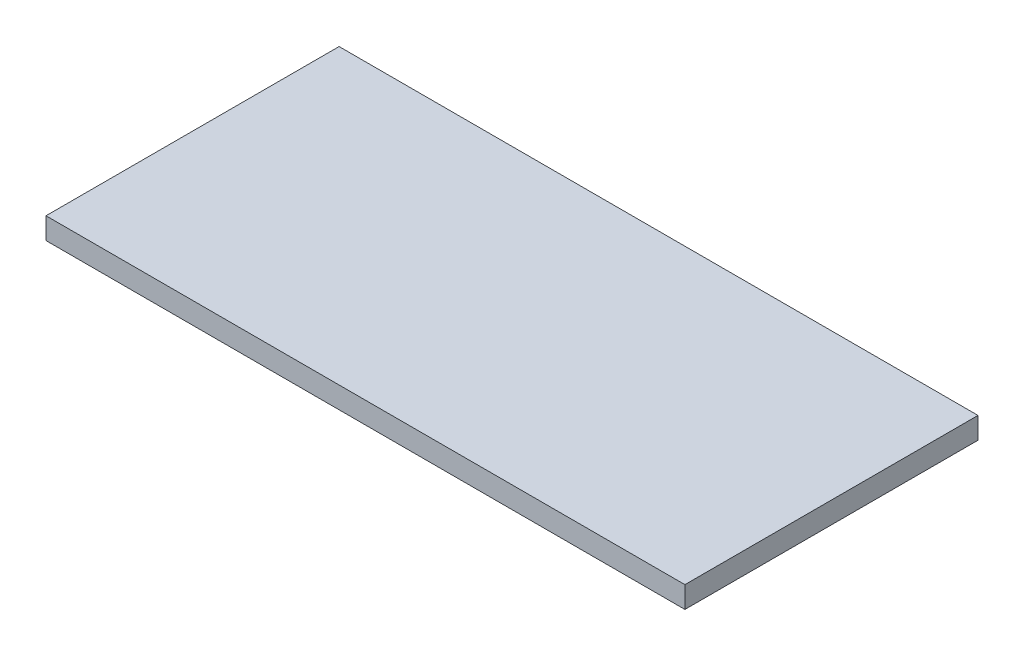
ISO-10303-21;
HEADER;
FILE_DESCRIPTION(('STEP AP214'),'2;1');
FILE_NAME('part.step','',(''),(''),'','','');
FILE_SCHEMA(('AUTOMOTIVE_DESIGN { 1 0 10303 214 1 1 1 1 }'));
ENDSEC;
DATA;
#1=APPLICATION_CONTEXT('core data for automotive mechanical design processes');
#2=APPLICATION_PROTOCOL_DEFINITION('international standard','automotive_design',2000,#1);
#3=PRODUCT_CONTEXT('',#1,'mechanical');
#4=PRODUCT('Part','Part','',(#3));
#5=PRODUCT_RELATED_PRODUCT_CATEGORY('part','',(#4));
#6=PRODUCT_DEFINITION_FORMATION('','',#4);
#7=PRODUCT_DEFINITION_CONTEXT('part definition',#1,'design');
#8=PRODUCT_DEFINITION('design','',#6,#7);
#9=PRODUCT_DEFINITION_SHAPE('','',#8);
#10=(LENGTH_UNIT() NAMED_UNIT(*) SI_UNIT(.MILLI.,.METRE.));
#11=(NAMED_UNIT(*) PLANE_ANGLE_UNIT() SI_UNIT($,.RADIAN.));
#12=(NAMED_UNIT(*) SI_UNIT($,.STERADIAN.) SOLID_ANGLE_UNIT());
#13=UNCERTAINTY_MEASURE_WITH_UNIT(LENGTH_MEASURE(1.E-05),#10,'distance_accuracy_value','');
#14=(GEOMETRIC_REPRESENTATION_CONTEXT(3) GLOBAL_UNCERTAINTY_ASSIGNED_CONTEXT((#13)) GLOBAL_UNIT_ASSIGNED_CONTEXT((#10,
#11,#12)) REPRESENTATION_CONTEXT('',''));
#15=CARTESIAN_POINT('',(0.,0.,0.));
#16=DIRECTION('',(0.,0.,1.));
#17=DIRECTION('',(1.,0.,0.));
#18=AXIS2_PLACEMENT_3D('',#15,#16,#17);
#19=CARTESIAN_POINT('',(151.5,5.1,-69.5));
#20=DIRECTION('',(-1.,0.,0.));
#21=DIRECTION('',(0.,0.,1.));
#22=AXIS2_PLACEMENT_3D('',#19,#20,#21);
#23=PLANE('',#22);
#24=DIRECTION('',(0.,0.,-1.));
#25=VECTOR('',#24,1.);
#26=CARTESIAN_POINT('',(151.5,-5.1,-69.5));
#27=LINE('',#26,#25);
#28=CARTESIAN_POINT('',(151.5,-5.1,69.5));
#29=VERTEX_POINT('',#28);
#30=CARTESIAN_POINT('',(151.5,-5.1,-69.5));
#31=VERTEX_POINT('',#30);
#32=EDGE_CURVE('E95',#29,#31,#27,.T.);
#33=ORIENTED_EDGE('',*,*,#32,.T.);
#34=DIRECTION('',(0.,-1.,0.));
#35=VECTOR('',#34,1.);
#36=CARTESIAN_POINT('',(151.5,5.1,-69.5));
#37=LINE('',#36,#35);
#38=CARTESIAN_POINT('',(151.5,5.1,-69.5));
#39=VERTEX_POINT('',#38);
#40=EDGE_CURVE('E11',#39,#31,#37,.T.);
#41=ORIENTED_EDGE('',*,*,#40,.F.);
#42=DIRECTION('',(0.,0.,-1.));
#43=VECTOR('',#42,1.);
#44=CARTESIAN_POINT('',(151.5,5.1,-69.5));
#45=LINE('',#44,#43);
#46=CARTESIAN_POINT('',(151.5,5.1,69.5));
#47=VERTEX_POINT('',#46);
#48=EDGE_CURVE('E83',#47,#39,#45,.T.);
#49=ORIENTED_EDGE('',*,*,#48,.F.);
#50=DIRECTION('',(0.,-1.,0.));
#51=VECTOR('',#50,1.);
#52=CARTESIAN_POINT('',(151.5,5.1,69.5));
#53=LINE('',#52,#51);
#54=EDGE_CURVE('E91',#47,#29,#53,.T.);
#55=ORIENTED_EDGE('',*,*,#54,.T.);
#56=EDGE_LOOP('',(#33,#41,#49,#55));
#57=FACE_BOUND('',#56,.T.);
#58=ADVANCED_FACE('F32',(#57),#23,.F.);
#59=CARTESIAN_POINT('',(-151.5,5.1,-69.5));
#60=DIRECTION('',(0.,0.,1.));
#61=DIRECTION('',(1.,0.,0.));
#62=AXIS2_PLACEMENT_3D('',#59,#60,#61);
#63=PLANE('',#62);
#64=DIRECTION('',(-1.,0.,0.));
#65=VECTOR('',#64,1.);
#66=CARTESIAN_POINT('',(-151.5,-5.1,-69.5));
#67=LINE('',#66,#65);
#68=CARTESIAN_POINT('',(-151.5,-5.1,-69.5));
#69=VERTEX_POINT('',#68);
#70=EDGE_CURVE('E87',#31,#69,#67,.T.);
#71=ORIENTED_EDGE('',*,*,#70,.T.);
#72=DIRECTION('',(0.,-1.,0.));
#73=VECTOR('',#72,1.);
#74=CARTESIAN_POINT('',(-151.5,5.1,-69.5));
#75=LINE('',#74,#73);
#76=CARTESIAN_POINT('',(-151.5,5.1,-69.5));
#77=VERTEX_POINT('',#76);
#78=EDGE_CURVE('E40',#77,#69,#75,.T.);
#79=ORIENTED_EDGE('',*,*,#78,.F.);
#80=DIRECTION('',(-1.,0.,0.));
#81=VECTOR('',#80,1.);
#82=CARTESIAN_POINT('',(-151.5,5.1,-69.5));
#83=LINE('',#82,#81);
#84=EDGE_CURVE('E78',#39,#77,#83,.T.);
#85=ORIENTED_EDGE('',*,*,#84,.F.);
#86=ORIENTED_EDGE('',*,*,#40,.T.);
#87=EDGE_LOOP('',(#71,#79,#85,#86));
#88=FACE_BOUND('',#87,.T.);
#89=ADVANCED_FACE('F86',(#88),#63,.F.);
#90=CARTESIAN_POINT('',(-151.5,5.1,-69.5));
#91=DIRECTION('',(1.,0.,0.));
#92=DIRECTION('',(0.,0.,-1.));
#93=AXIS2_PLACEMENT_3D('',#90,#91,#92);
#94=PLANE('',#93);
#95=DIRECTION('',(0.,0.,1.));
#96=VECTOR('',#95,1.);
#97=CARTESIAN_POINT('',(-151.5,-5.1,-69.5));
#98=LINE('',#97,#96);
#99=CARTESIAN_POINT('',(-151.5,-5.1,69.5));
#100=VERTEX_POINT('',#99);
#101=EDGE_CURVE('E65',#69,#100,#98,.T.);
#102=ORIENTED_EDGE('',*,*,#101,.T.);
#103=DIRECTION('',(0.,-1.,0.));
#104=VECTOR('',#103,1.);
#105=CARTESIAN_POINT('',(-151.5,5.1,69.5));
#106=LINE('',#105,#104);
#107=CARTESIAN_POINT('',(-151.5,5.1,69.5));
#108=VERTEX_POINT('',#107);
#109=EDGE_CURVE('E88',#108,#100,#106,.T.);
#110=ORIENTED_EDGE('',*,*,#109,.F.);
#111=DIRECTION('',(0.,0.,1.));
#112=VECTOR('',#111,1.);
#113=CARTESIAN_POINT('',(-151.5,5.1,-69.5));
#114=LINE('',#113,#112);
#115=EDGE_CURVE('E81',#77,#108,#114,.T.);
#116=ORIENTED_EDGE('',*,*,#115,.F.);
#117=ORIENTED_EDGE('',*,*,#78,.T.);
#118=EDGE_LOOP('',(#102,#110,#116,#117));
#119=FACE_BOUND('',#118,.T.);
#120=ADVANCED_FACE('F89',(#119),#94,.F.);
#121=CARTESIAN_POINT('',(-151.5,5.1,69.5));
#122=DIRECTION('',(0.,0.,-1.));
#123=DIRECTION('',(-1.,0.,0.));
#124=AXIS2_PLACEMENT_3D('',#121,#122,#123);
#125=PLANE('',#124);
#126=DIRECTION('',(1.,0.,0.));
#127=VECTOR('',#126,1.);
#128=CARTESIAN_POINT('',(-151.5,-5.1,69.5));
#129=LINE('',#128,#127);
#130=EDGE_CURVE('E71',#100,#29,#129,.T.);
#131=ORIENTED_EDGE('',*,*,#130,.T.);
#132=ORIENTED_EDGE('',*,*,#54,.F.);
#133=DIRECTION('',(1.,0.,0.));
#134=VECTOR('',#133,1.);
#135=CARTESIAN_POINT('',(-151.5,5.1,69.5));
#136=LINE('',#135,#134);
#137=EDGE_CURVE('E48',#108,#47,#136,.T.);
#138=ORIENTED_EDGE('',*,*,#137,.F.);
#139=ORIENTED_EDGE('',*,*,#109,.T.);
#140=EDGE_LOOP('',(#131,#132,#138,#139));
#141=FACE_BOUND('',#140,.T.);
#142=ADVANCED_FACE('F102',(#141),#125,.F.);
#143=CARTESIAN_POINT('',(0.,5.1,0.));
#144=DIRECTION('',(0.,1.,0.));
#145=DIRECTION('',(0.,0.,1.));
#146=AXIS2_PLACEMENT_3D('',#143,#144,#145);
#147=PLANE('',#146);
#148=ORIENTED_EDGE('',*,*,#48,.T.);
#149=ORIENTED_EDGE('',*,*,#84,.T.);
#150=ORIENTED_EDGE('',*,*,#115,.T.);
#151=ORIENTED_EDGE('',*,*,#137,.T.);
#152=EDGE_LOOP('',(#148,#149,#150,#151));
#153=FACE_BOUND('',#152,.T.);
#154=ADVANCED_FACE('F79',(#153),#147,.T.);
#155=CARTESIAN_POINT('',(0.,-5.1,0.));
#156=DIRECTION('',(0.,1.,0.));
#157=DIRECTION('',(0.,0.,1.));
#158=AXIS2_PLACEMENT_3D('',#155,#156,#157);
#159=PLANE('',#158);
#160=ORIENTED_EDGE('',*,*,#32,.F.);
#161=ORIENTED_EDGE('',*,*,#130,.F.);
#162=ORIENTED_EDGE('',*,*,#101,.F.);
#163=ORIENTED_EDGE('',*,*,#70,.F.);
#164=EDGE_LOOP('',(#160,#161,#162,#163));
#165=FACE_BOUND('',#164,.T.);
#166=ADVANCED_FACE('F105',(#165),#159,.F.);
#167=CLOSED_SHELL('',(#58,#89,#120,#142,#154,#166));
#168=MANIFOLD_SOLID_BREP('B2',#167);
#169=ADVANCED_BREP_SHAPE_REPRESENTATION('',(#18,#168),#14);
#170=SHAPE_DEFINITION_REPRESENTATION(#9,#169);
ENDSEC;
END-ISO-10303-21;
